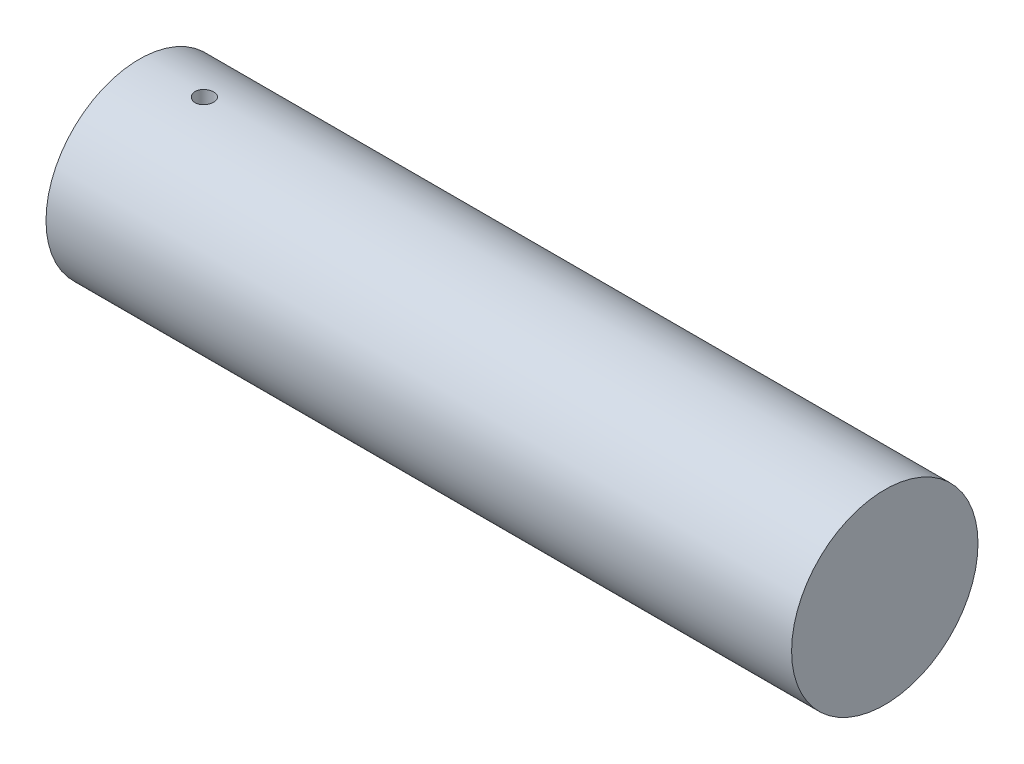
from build123d import *

# Parameters (mm, degrees)
SKETCH_1_R          = 5
EXTRUDE_1_DEPTH     = 40
SKETCH_2_R          = 0.5
CUT_EXTRUDE_1_DEPTH = 20
SKETCH_3_R          = 1.25
CUT_EXTRUDE_2_DEPTH = 10


with BuildPart() as part:
    # Sketch 1 → Extrude 1 (new body)
    with BuildSketch(Plane(origin=(0, 0, 0), x_dir=(0, 0, -1), z_dir=(1, 0, 0))):
        Circle(SKETCH_1_R)
    extrude(amount=EXTRUDE_1_DEPTH)

    # Sketch 2 → Cut-Extrude 1 (cut, symmetric)
    with BuildSketch(Plane(origin=(0, 0, 0), x_dir=(1, 0, 0), z_dir=(0, 1, 0))):
        with Locations(Location((3.5, 0, 0), (0, 0, 270))):
            Circle(SKETCH_2_R)
    extrude(amount=CUT_EXTRUDE_1_DEPTH, both=True, mode=Mode.SUBTRACT)

    # Sketch 3 → Cut-Extrude 2 (cut)
    with BuildSketch(Plane.ZY):
        Circle(SKETCH_3_R)
    extrude(amount=-CUT_EXTRUDE_2_DEPTH, mode=Mode.SUBTRACT)


solid = part.part
